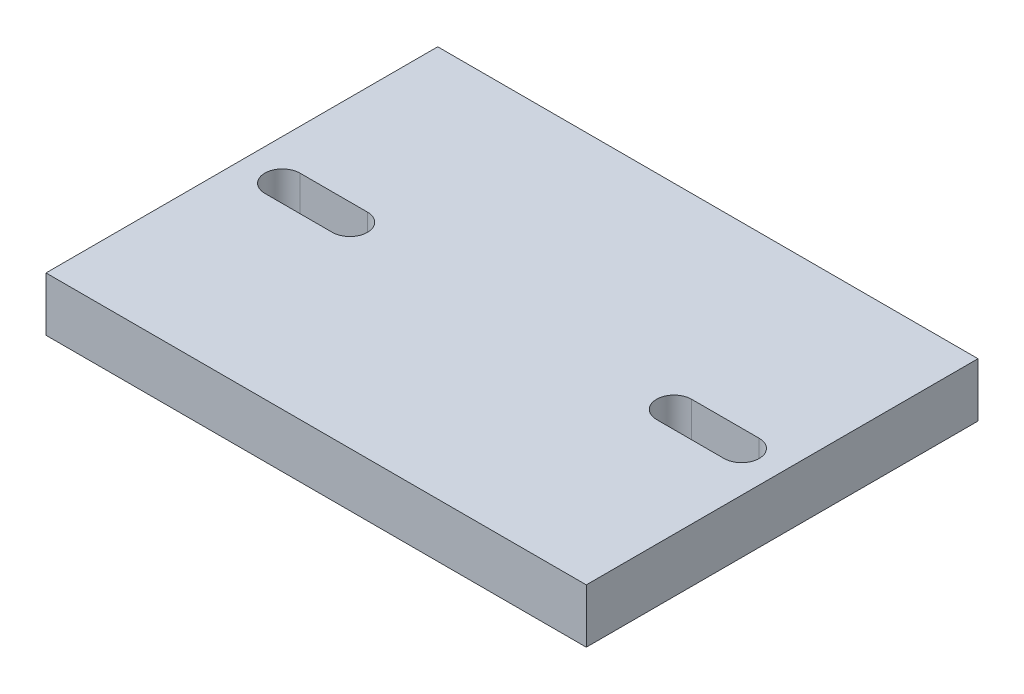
from build123d import *

# Parameters (mm, degrees)
SKETCH_2_W          = 80
SKETCH_2_H          = 8
EXTRUDE_2_DEPTH     = 58
CUT_EXTRUDE_1_DEPTH = 100.136269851


with BuildPart() as part:
    # Sketch 2 → Extrude 2 (new body)
    with BuildSketch(Plane.XY):
        with Locations((-40, 4)):
            Rectangle(SKETCH_2_W, SKETCH_2_H)
    extrude(amount=EXTRUDE_2_DEPTH)

    # Sketch 3 → Cut-Extrude 1 (cut, through all)
    with BuildSketch(Plane(origin=(0, 8, 0), x_dir=(1, 0, 0), z_dir=(0, 1, 0))):
        with BuildLine():
            Line((-74, -26.4), (-64, -26.4))
            ThreePointArc((-64, -26.4), (-61.4, -29), (-64, -31.6))
            Line((-64, -31.6), (-74, -31.6))
            ThreePointArc((-74, -31.6), (-76.6, -29), (-74, -26.4))
        make_face()
        with BuildLine():
            Line((-6, -31.6), (-16, -31.6))
            ThreePointArc((-16, -31.6), (-18.6, -29), (-16, -26.4))
            Line((-16, -26.4), (-6, -26.4))
            ThreePointArc((-6, -26.4), (-3.4, -29), (-6, -31.6))
        make_face()
    extrude(amount=-CUT_EXTRUDE_1_DEPTH, mode=Mode.SUBTRACT)


solid = part.part
